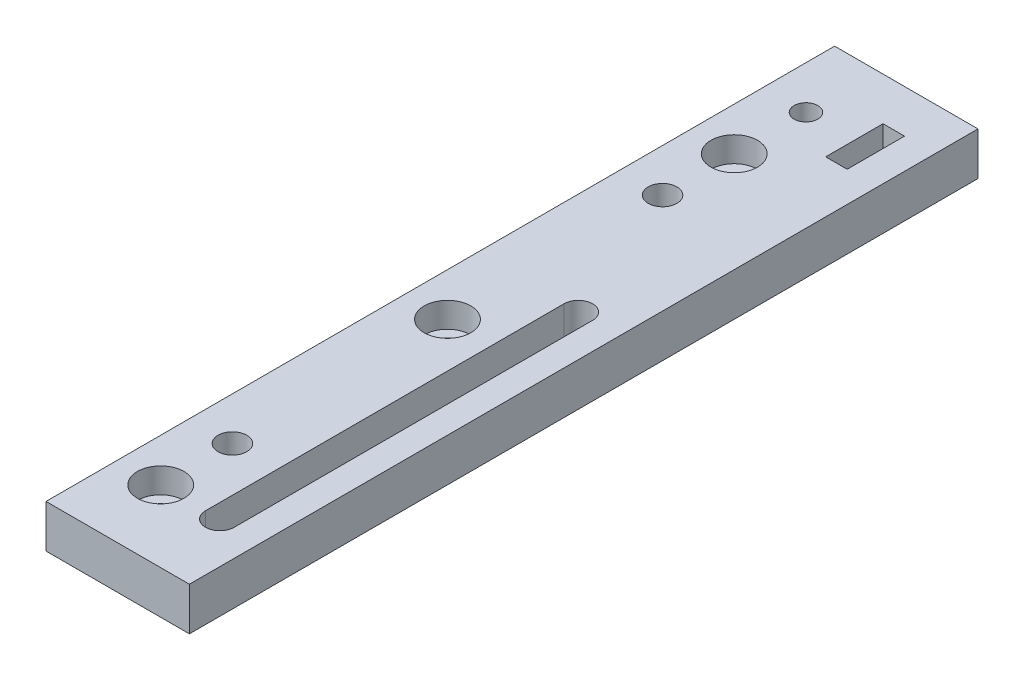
ISO-10303-21;
HEADER;
FILE_DESCRIPTION(('STEP AP214'),'2;1');
FILE_NAME('part.step','',(''),(''),'','','');
FILE_SCHEMA(('AUTOMOTIVE_DESIGN { 1 0 10303 214 1 1 1 1 }'));
ENDSEC;
DATA;
#1=APPLICATION_CONTEXT('core data for automotive mechanical design processes');
#2=APPLICATION_PROTOCOL_DEFINITION('international standard','automotive_design',2000,#1);
#3=PRODUCT_CONTEXT('',#1,'mechanical');
#4=PRODUCT('Part','Part','',(#3));
#5=PRODUCT_RELATED_PRODUCT_CATEGORY('part','',(#4));
#6=PRODUCT_DEFINITION_FORMATION('','',#4);
#7=PRODUCT_DEFINITION_CONTEXT('part definition',#1,'design');
#8=PRODUCT_DEFINITION('design','',#6,#7);
#9=PRODUCT_DEFINITION_SHAPE('','',#8);
#10=(LENGTH_UNIT() NAMED_UNIT(*) SI_UNIT(.MILLI.,.METRE.));
#11=(NAMED_UNIT(*) PLANE_ANGLE_UNIT() SI_UNIT($,.RADIAN.));
#12=(NAMED_UNIT(*) SI_UNIT($,.STERADIAN.) SOLID_ANGLE_UNIT());
#13=UNCERTAINTY_MEASURE_WITH_UNIT(LENGTH_MEASURE(1.E-05),#10,'distance_accuracy_value','');
#14=(GEOMETRIC_REPRESENTATION_CONTEXT(3) GLOBAL_UNCERTAINTY_ASSIGNED_CONTEXT((#13)) GLOBAL_UNIT_ASSIGNED_CONTEXT((#10,
#11,#12)) REPRESENTATION_CONTEXT('',''));
#15=CARTESIAN_POINT('',(0.,0.,0.));
#16=DIRECTION('',(0.,0.,1.));
#17=DIRECTION('',(1.,0.,0.));
#18=AXIS2_PLACEMENT_3D('',#15,#16,#17);
#19=CARTESIAN_POINT('',(6.,-104.,100.));
#20=DIRECTION('',(0.,1.,0.));
#21=DIRECTION('',(0.,0.,1.));
#22=AXIS2_PLACEMENT_3D('',#19,#20,#21);
#23=CYLINDRICAL_SURFACE('',#22,1.75);
#24=CARTESIAN_POINT('',(6.,0.,100.));
#25=DIRECTION('',(0.,1.,0.));
#26=DIRECTION('',(0.,0.,1.));
#27=AXIS2_PLACEMENT_3D('',#24,#25,#26);
#28=CIRCLE('',#27,1.75);
#29=CARTESIAN_POINT('',(6.,0.,101.75));
#30=VERTEX_POINT('',#29);
#31=EDGE_CURVE('E208',#30,#30,#28,.T.);
#32=ORIENTED_EDGE('',*,*,#31,.F.);
#33=EDGE_LOOP('',(#32));
#34=FACE_BOUND('',#33,.T.);
#35=CARTESIAN_POINT('',(6.,2.5,100.));
#36=DIRECTION('',(0.,1.,0.));
#37=DIRECTION('',(0.,0.,1.));
#38=AXIS2_PLACEMENT_3D('',#35,#36,#37);
#39=CIRCLE('',#38,1.75);
#40=CARTESIAN_POINT('',(6.,2.5,101.75));
#41=VERTEX_POINT('',#40);
#42=EDGE_CURVE('E40',#41,#41,#39,.F.);
#43=ORIENTED_EDGE('',*,*,#42,.F.);
#44=EDGE_LOOP('',(#43));
#45=FACE_BOUND('',#44,.T.);
#46=ADVANCED_FACE('F36',(#34,#45),#23,.F.);
#47=CARTESIAN_POINT('',(6.,-104.,60.));
#48=DIRECTION('',(0.,1.,0.));
#49=DIRECTION('',(0.,0.,1.));
#50=AXIS2_PLACEMENT_3D('',#47,#48,#49);
#51=CYLINDRICAL_SURFACE('',#50,1.75);
#52=CARTESIAN_POINT('',(6.,0.,60.));
#53=DIRECTION('',(0.,1.,0.));
#54=DIRECTION('',(0.,0.,1.));
#55=AXIS2_PLACEMENT_3D('',#52,#53,#54);
#56=CIRCLE('',#55,1.75);
#57=CARTESIAN_POINT('',(6.,0.,61.75));
#58=VERTEX_POINT('',#57);
#59=EDGE_CURVE('E211',#58,#58,#56,.T.);
#60=ORIENTED_EDGE('',*,*,#59,.F.);
#61=EDGE_LOOP('',(#60));
#62=FACE_BOUND('',#61,.T.);
#63=CARTESIAN_POINT('',(6.,2.5,60.));
#64=DIRECTION('',(0.,1.,0.));
#65=DIRECTION('',(0.,0.,1.));
#66=AXIS2_PLACEMENT_3D('',#63,#64,#65);
#67=CIRCLE('',#66,1.75);
#68=CARTESIAN_POINT('',(6.,2.5,61.75));
#69=VERTEX_POINT('',#68);
#70=EDGE_CURVE('E247',#69,#69,#67,.F.);
#71=ORIENTED_EDGE('',*,*,#70,.F.);
#72=EDGE_LOOP('',(#71));
#73=FACE_BOUND('',#72,.T.);
#74=ADVANCED_FACE('F292',(#62,#73),#51,.F.);
#75=CARTESIAN_POINT('',(6.,-104.,20.));
#76=DIRECTION('',(0.,1.,0.));
#77=DIRECTION('',(0.,0.,1.));
#78=AXIS2_PLACEMENT_3D('',#75,#76,#77);
#79=CYLINDRICAL_SURFACE('',#78,1.75);
#80=CARTESIAN_POINT('',(6.,0.,20.));
#81=DIRECTION('',(0.,1.,0.));
#82=DIRECTION('',(0.,0.,1.));
#83=AXIS2_PLACEMENT_3D('',#80,#81,#82);
#84=CIRCLE('',#83,1.75);
#85=CARTESIAN_POINT('',(6.,0.,21.75));
#86=VERTEX_POINT('',#85);
#87=EDGE_CURVE('E214',#86,#86,#84,.T.);
#88=ORIENTED_EDGE('',*,*,#87,.F.);
#89=EDGE_LOOP('',(#88));
#90=FACE_BOUND('',#89,.T.);
#91=CARTESIAN_POINT('',(6.,2.5,20.));
#92=DIRECTION('',(0.,1.,0.));
#93=DIRECTION('',(0.,0.,1.));
#94=AXIS2_PLACEMENT_3D('',#91,#92,#93);
#95=CIRCLE('',#94,1.75);
#96=CARTESIAN_POINT('',(6.,2.5,21.75));
#97=VERTEX_POINT('',#96);
#98=EDGE_CURVE('E243',#97,#97,#95,.F.);
#99=ORIENTED_EDGE('',*,*,#98,.F.);
#100=EDGE_LOOP('',(#99));
#101=FACE_BOUND('',#100,.T.);
#102=ADVANCED_FACE('F298',(#90,#101),#79,.F.);
#103=CARTESIAN_POINT('',(0.,0.,110.));
#104=DIRECTION('',(0.,1.,0.));
#105=DIRECTION('',(0.,0.,1.));
#106=AXIS2_PLACEMENT_3D('',#103,#104,#105);
#107=PLANE('',#106);
#108=CARTESIAN_POINT('',(6.,0.,10.));
#109=DIRECTION('',(0.,1.,0.));
#110=DIRECTION('',(0.,0.,1.));
#111=AXIS2_PLACEMENT_3D('',#108,#109,#110);
#112=CIRCLE('',#111,1.65);
#113=CARTESIAN_POINT('',(6.,0.,11.65));
#114=VERTEX_POINT('',#113);
#115=EDGE_CURVE('E270',#114,#114,#112,.T.);
#116=ORIENTED_EDGE('',*,*,#115,.T.);
#117=EDGE_LOOP('',(#116));
#118=FACE_BOUND('',#117,.T.);
#119=DIRECTION('',(0.,0.,1.));
#120=VECTOR('',#119,1.);
#121=CARTESIAN_POINT('',(12.7500000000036,0.,110.));
#122=LINE('',#121,#120);
#123=CARTESIAN_POINT('',(12.7500000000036,0.,6.));
#124=VERTEX_POINT('',#123);
#125=CARTESIAN_POINT('',(12.7500000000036,0.,14.));
#126=VERTEX_POINT('',#125);
#127=EDGE_CURVE('E158',#124,#126,#122,.T.);
#128=ORIENTED_EDGE('',*,*,#127,.T.);
#129=DIRECTION('',(1.,0.,0.));
#130=VECTOR('',#129,1.);
#131=CARTESIAN_POINT('',(0.,0.,14.));
#132=LINE('',#131,#130);
#133=CARTESIAN_POINT('',(15.7500000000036,0.,14.));
#134=VERTEX_POINT('',#133);
#135=EDGE_CURVE('E161',#126,#134,#132,.T.);
#136=ORIENTED_EDGE('',*,*,#135,.T.);
#137=DIRECTION('',(0.,0.,-1.));
#138=VECTOR('',#137,1.);
#139=CARTESIAN_POINT('',(15.7500000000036,0.,110.));
#140=LINE('',#139,#138);
#141=CARTESIAN_POINT('',(15.7500000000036,0.,6.00000000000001));
#142=VERTEX_POINT('',#141);
#143=EDGE_CURVE('E153',#134,#142,#140,.T.);
#144=ORIENTED_EDGE('',*,*,#143,.T.);
#145=DIRECTION('',(-1.,0.,0.));
#146=VECTOR('',#145,1.);
#147=CARTESIAN_POINT('',(0.,0.,6.00000000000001));
#148=LINE('',#147,#146);
#149=EDGE_CURVE('E133',#142,#124,#148,.T.);
#150=ORIENTED_EDGE('',*,*,#149,.T.);
#151=EDGE_LOOP('',(#128,#136,#144,#150));
#152=FACE_BOUND('',#151,.T.);
#153=DIRECTION('',(0.,0.,-1.));
#154=VECTOR('',#153,1.);
#155=CARTESIAN_POINT('',(16.2500000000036,0.,110.));
#156=LINE('',#155,#154);
#157=CARTESIAN_POINT('',(16.2500000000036,0.,100.));
#158=VERTEX_POINT('',#157);
#159=CARTESIAN_POINT('',(16.2500000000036,0.,50.));
#160=VERTEX_POINT('',#159);
#161=EDGE_CURVE('E190',#158,#160,#156,.T.);
#162=ORIENTED_EDGE('',*,*,#161,.T.);
#163=CARTESIAN_POINT('',(14.2500000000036,0.,50.));
#164=DIRECTION('',(0.,1.,0.));
#165=DIRECTION('',(0.,0.,1.));
#166=AXIS2_PLACEMENT_3D('',#163,#164,#165);
#167=CIRCLE('',#166,2.);
#168=CARTESIAN_POINT('',(12.2500000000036,0.,50.));
#169=VERTEX_POINT('',#168);
#170=EDGE_CURVE('E193',#160,#169,#167,.T.);
#171=ORIENTED_EDGE('',*,*,#170,.T.);
#172=DIRECTION('',(0.,0.,1.));
#173=VECTOR('',#172,1.);
#174=CARTESIAN_POINT('',(12.2500000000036,0.,110.));
#175=LINE('',#174,#173);
#176=CARTESIAN_POINT('',(12.2500000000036,0.,100.));
#177=VERTEX_POINT('',#176);
#178=EDGE_CURVE('E178',#169,#177,#175,.T.);
#179=ORIENTED_EDGE('',*,*,#178,.T.);
#180=CARTESIAN_POINT('',(14.2500000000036,0.,100.));
#181=DIRECTION('',(0.,1.,0.));
#182=DIRECTION('',(0.,0.,1.));
#183=AXIS2_PLACEMENT_3D('',#180,#181,#182);
#184=CIRCLE('',#183,2.);
#185=EDGE_CURVE('E187',#177,#158,#184,.T.);
#186=ORIENTED_EDGE('',*,*,#185,.T.);
#187=EDGE_LOOP('',(#162,#171,#179,#186));
#188=FACE_BOUND('',#187,.T.);
#189=CARTESIAN_POINT('',(6.,0.,90.));
#190=DIRECTION('',(0.,1.,0.));
#191=DIRECTION('',(0.,0.,1.));
#192=AXIS2_PLACEMENT_3D('',#189,#190,#191);
#193=CIRCLE('',#192,2.00000000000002);
#194=CARTESIAN_POINT('',(6.,0.,92.));
#195=VERTEX_POINT('',#194);
#196=EDGE_CURVE('E199',#195,#195,#193,.T.);
#197=ORIENTED_EDGE('',*,*,#196,.T.);
#198=EDGE_LOOP('',(#197));
#199=FACE_BOUND('',#198,.T.);
#200=CARTESIAN_POINT('',(6.,0.,30.));
#201=DIRECTION('',(0.,1.,0.));
#202=DIRECTION('',(0.,0.,1.));
#203=AXIS2_PLACEMENT_3D('',#200,#201,#202);
#204=CIRCLE('',#203,2.00000000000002);
#205=CARTESIAN_POINT('',(6.,0.,32.));
#206=VERTEX_POINT('',#205);
#207=EDGE_CURVE('E205',#206,#206,#204,.T.);
#208=ORIENTED_EDGE('',*,*,#207,.T.);
#209=EDGE_LOOP('',(#208));
#210=FACE_BOUND('',#209,.T.);
#211=ORIENTED_EDGE('',*,*,#31,.T.);
#212=EDGE_LOOP('',(#211));
#213=FACE_BOUND('',#212,.T.);
#214=ORIENTED_EDGE('',*,*,#59,.T.);
#215=EDGE_LOOP('',(#214));
#216=FACE_BOUND('',#215,.T.);
#217=ORIENTED_EDGE('',*,*,#87,.T.);
#218=EDGE_LOOP('',(#217));
#219=FACE_BOUND('',#218,.T.);
#220=DIRECTION('',(1.,0.,0.));
#221=VECTOR('',#220,1.);
#222=CARTESIAN_POINT('',(0.,0.,0.));
#223=LINE('',#222,#221);
#224=CARTESIAN_POINT('',(0.,0.,0.));
#225=VERTEX_POINT('',#224);
#226=CARTESIAN_POINT('',(20.,0.,0.));
#227=VERTEX_POINT('',#226);
#228=EDGE_CURVE('E217',#225,#227,#223,.T.);
#229=ORIENTED_EDGE('',*,*,#228,.T.);
#230=DIRECTION('',(0.,0.,-1.));
#231=VECTOR('',#230,1.);
#232=CARTESIAN_POINT('',(20.,0.,110.));
#233=LINE('',#232,#231);
#234=CARTESIAN_POINT('',(20.,0.,110.));
#235=VERTEX_POINT('',#234);
#236=EDGE_CURVE('E12',#235,#227,#233,.T.);
#237=ORIENTED_EDGE('',*,*,#236,.F.);
#238=DIRECTION('',(1.,0.,0.));
#239=VECTOR('',#238,1.);
#240=CARTESIAN_POINT('',(0.,0.,110.));
#241=LINE('',#240,#239);
#242=CARTESIAN_POINT('',(0.,0.,110.));
#243=VERTEX_POINT('',#242);
#244=EDGE_CURVE('E218',#243,#235,#241,.T.);
#245=ORIENTED_EDGE('',*,*,#244,.F.);
#246=DIRECTION('',(0.,0.,-1.));
#247=VECTOR('',#246,1.);
#248=CARTESIAN_POINT('',(0.,0.,110.));
#249=LINE('',#248,#247);
#250=EDGE_CURVE('E228',#243,#225,#249,.T.);
#251=ORIENTED_EDGE('',*,*,#250,.T.);
#252=EDGE_LOOP('',(#229,#237,#245,#251));
#253=FACE_BOUND('',#252,.T.);
#254=ADVANCED_FACE('F38',(#118,#152,#188,#199,#210,#213,#216,#219,#253),#107,.F.);
#255=CARTESIAN_POINT('',(20.,0.,110.));
#256=DIRECTION('',(-1.,0.,0.));
#257=DIRECTION('',(0.,0.,1.));
#258=AXIS2_PLACEMENT_3D('',#255,#256,#257);
#259=PLANE('',#258);
#260=DIRECTION('',(0.,1.,0.));
#261=VECTOR('',#260,1.);
#262=CARTESIAN_POINT('',(20.,0.,0.));
#263=LINE('',#262,#261);
#264=CARTESIAN_POINT('',(20.,6.,0.));
#265=VERTEX_POINT('',#264);
#266=EDGE_CURVE('E231',#227,#265,#263,.T.);
#267=ORIENTED_EDGE('',*,*,#266,.T.);
#268=DIRECTION('',(0.,0.,-1.));
#269=VECTOR('',#268,1.);
#270=CARTESIAN_POINT('',(20.,6.,110.));
#271=LINE('',#270,#269);
#272=CARTESIAN_POINT('',(20.,6.,110.));
#273=VERTEX_POINT('',#272);
#274=EDGE_CURVE('E45',#273,#265,#271,.T.);
#275=ORIENTED_EDGE('',*,*,#274,.F.);
#276=DIRECTION('',(0.,1.,0.));
#277=VECTOR('',#276,1.);
#278=CARTESIAN_POINT('',(20.,0.,110.));
#279=LINE('',#278,#277);
#280=EDGE_CURVE('E221',#235,#273,#279,.T.);
#281=ORIENTED_EDGE('',*,*,#280,.F.);
#282=ORIENTED_EDGE('',*,*,#236,.T.);
#283=EDGE_LOOP('',(#267,#275,#281,#282));
#284=FACE_BOUND('',#283,.T.);
#285=ADVANCED_FACE('F323',(#284),#259,.F.);
#286=CARTESIAN_POINT('',(0.,6.,110.));
#287=DIRECTION('',(0.,-1.,0.));
#288=DIRECTION('',(0.,0.,-1.));
#289=AXIS2_PLACEMENT_3D('',#286,#287,#288);
#290=PLANE('',#289);
#291=CARTESIAN_POINT('',(6.,6.,100.));
#292=DIRECTION('',(0.,1.,0.));
#293=DIRECTION('',(0.,0.,1.));
#294=AXIS2_PLACEMENT_3D('',#291,#292,#293);
#295=CIRCLE('',#294,3.25);
#296=CARTESIAN_POINT('',(6.,6.,103.25));
#297=VERTEX_POINT('',#296);
#298=EDGE_CURVE('E263',#297,#297,#295,.T.);
#299=ORIENTED_EDGE('',*,*,#298,.F.);
#300=EDGE_LOOP('',(#299));
#301=FACE_BOUND('',#300,.T.);
#302=CARTESIAN_POINT('',(6.,6.,60.));
#303=DIRECTION('',(0.,1.,0.));
#304=DIRECTION('',(0.,0.,1.));
#305=AXIS2_PLACEMENT_3D('',#302,#303,#304);
#306=CIRCLE('',#305,3.25);
#307=CARTESIAN_POINT('',(6.,6.,63.25));
#308=VERTEX_POINT('',#307);
#309=EDGE_CURVE('E256',#308,#308,#306,.T.);
#310=ORIENTED_EDGE('',*,*,#309,.F.);
#311=EDGE_LOOP('',(#310));
#312=FACE_BOUND('',#311,.T.);
#313=CARTESIAN_POINT('',(6.,6.,20.));
#314=DIRECTION('',(0.,1.,0.));
#315=DIRECTION('',(0.,0.,1.));
#316=AXIS2_PLACEMENT_3D('',#313,#314,#315);
#317=CIRCLE('',#316,3.25);
#318=CARTESIAN_POINT('',(6.,6.,23.25));
#319=VERTEX_POINT('',#318);
#320=EDGE_CURVE('E249',#319,#319,#317,.T.);
#321=ORIENTED_EDGE('',*,*,#320,.F.);
#322=EDGE_LOOP('',(#321));
#323=FACE_BOUND('',#322,.T.);
#324=CARTESIAN_POINT('',(6.,6.,10.));
#325=DIRECTION('',(0.,1.,0.));
#326=DIRECTION('',(0.,0.,1.));
#327=AXIS2_PLACEMENT_3D('',#324,#325,#326);
#328=CIRCLE('',#327,1.65);
#329=CARTESIAN_POINT('',(6.,6.,11.65));
#330=VERTEX_POINT('',#329);
#331=EDGE_CURVE('E245',#330,#330,#328,.T.);
#332=ORIENTED_EDGE('',*,*,#331,.F.);
#333=EDGE_LOOP('',(#332));
#334=FACE_BOUND('',#333,.T.);
#335=DIRECTION('',(0.,0.,-1.));
#336=VECTOR('',#335,1.);
#337=CARTESIAN_POINT('',(15.7500000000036,6.,14.));
#338=LINE('',#337,#336);
#339=CARTESIAN_POINT('',(15.7500000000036,6.,14.));
#340=VERTEX_POINT('',#339);
#341=CARTESIAN_POINT('',(15.7500000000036,6.,6.));
#342=VERTEX_POINT('',#341);
#343=EDGE_CURVE('E139',#340,#342,#338,.T.);
#344=ORIENTED_EDGE('',*,*,#343,.F.);
#345=DIRECTION('',(1.,0.,0.));
#346=VECTOR('',#345,1.);
#347=CARTESIAN_POINT('',(12.7500000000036,6.,14.));
#348=LINE('',#347,#346);
#349=CARTESIAN_POINT('',(12.7500000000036,6.,14.));
#350=VERTEX_POINT('',#349);
#351=EDGE_CURVE('E61',#350,#340,#348,.T.);
#352=ORIENTED_EDGE('',*,*,#351,.F.);
#353=DIRECTION('',(0.,0.,1.));
#354=VECTOR('',#353,1.);
#355=CARTESIAN_POINT('',(12.7500000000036,6.,14.));
#356=LINE('',#355,#354);
#357=CARTESIAN_POINT('',(12.7500000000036,6.,6.));
#358=VERTEX_POINT('',#357);
#359=EDGE_CURVE('E146',#358,#350,#356,.T.);
#360=ORIENTED_EDGE('',*,*,#359,.F.);
#361=DIRECTION('',(-1.,0.,0.));
#362=VECTOR('',#361,1.);
#363=CARTESIAN_POINT('',(12.7500000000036,6.,6.));
#364=LINE('',#363,#362);
#365=EDGE_CURVE('E130',#342,#358,#364,.T.);
#366=ORIENTED_EDGE('',*,*,#365,.F.);
#367=EDGE_LOOP('',(#344,#352,#360,#366));
#368=FACE_BOUND('',#367,.T.);
#369=DIRECTION('',(0.,0.,1.));
#370=VECTOR('',#369,1.);
#371=CARTESIAN_POINT('',(12.2500000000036,6.,50.));
#372=LINE('',#371,#370);
#373=CARTESIAN_POINT('',(12.2500000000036,6.,50.));
#374=VERTEX_POINT('',#373);
#375=CARTESIAN_POINT('',(12.2500000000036,6.,100.));
#376=VERTEX_POINT('',#375);
#377=EDGE_CURVE('E166',#374,#376,#372,.T.);
#378=ORIENTED_EDGE('',*,*,#377,.F.);
#379=CARTESIAN_POINT('',(14.2500000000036,6.,50.));
#380=DIRECTION('',(0.,1.,0.));
#381=DIRECTION('',(0.,0.,1.));
#382=AXIS2_PLACEMENT_3D('',#379,#380,#381);
#383=CIRCLE('',#382,2.);
#384=CARTESIAN_POINT('',(16.2500000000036,6.,50.));
#385=VERTEX_POINT('',#384);
#386=EDGE_CURVE('E164',#385,#374,#383,.T.);
#387=ORIENTED_EDGE('',*,*,#386,.F.);
#388=DIRECTION('',(0.,0.,-1.));
#389=VECTOR('',#388,1.);
#390=CARTESIAN_POINT('',(16.2500000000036,6.,100.));
#391=LINE('',#390,#389);
#392=CARTESIAN_POINT('',(16.2500000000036,6.,100.));
#393=VERTEX_POINT('',#392);
#394=EDGE_CURVE('E172',#393,#385,#391,.T.);
#395=ORIENTED_EDGE('',*,*,#394,.F.);
#396=CARTESIAN_POINT('',(14.2500000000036,6.,100.));
#397=DIRECTION('',(0.,1.,0.));
#398=DIRECTION('',(0.,0.,1.));
#399=AXIS2_PLACEMENT_3D('',#396,#397,#398);
#400=CIRCLE('',#399,2.);
#401=EDGE_CURVE('E169',#376,#393,#400,.T.);
#402=ORIENTED_EDGE('',*,*,#401,.F.);
#403=EDGE_LOOP('',(#378,#387,#395,#402));
#404=FACE_BOUND('',#403,.T.);
#405=CARTESIAN_POINT('',(6.,6.,90.));
#406=DIRECTION('',(0.,1.,0.));
#407=DIRECTION('',(0.,0.,1.));
#408=AXIS2_PLACEMENT_3D('',#405,#406,#407);
#409=CIRCLE('',#408,2.00000000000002);
#410=CARTESIAN_POINT('',(6.,6.,92.));
#411=VERTEX_POINT('',#410);
#412=EDGE_CURVE('E196',#411,#411,#409,.T.);
#413=ORIENTED_EDGE('',*,*,#412,.F.);
#414=EDGE_LOOP('',(#413));
#415=FACE_BOUND('',#414,.T.);
#416=CARTESIAN_POINT('',(6.,6.,30.));
#417=DIRECTION('',(0.,1.,0.));
#418=DIRECTION('',(0.,0.,1.));
#419=AXIS2_PLACEMENT_3D('',#416,#417,#418);
#420=CIRCLE('',#419,2.00000000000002);
#421=CARTESIAN_POINT('',(6.,6.,32.));
#422=VERTEX_POINT('',#421);
#423=EDGE_CURVE('E202',#422,#422,#420,.T.);
#424=ORIENTED_EDGE('',*,*,#423,.F.);
#425=EDGE_LOOP('',(#424));
#426=FACE_BOUND('',#425,.T.);
#427=DIRECTION('',(-1.,0.,0.));
#428=VECTOR('',#427,1.);
#429=CARTESIAN_POINT('',(0.,6.,0.));
#430=LINE('',#429,#428);
#431=CARTESIAN_POINT('',(0.,6.,0.));
#432=VERTEX_POINT('',#431);
#433=EDGE_CURVE('E233',#265,#432,#430,.T.);
#434=ORIENTED_EDGE('',*,*,#433,.T.);
#435=DIRECTION('',(0.,0.,-1.));
#436=VECTOR('',#435,1.);
#437=CARTESIAN_POINT('',(0.,6.,110.));
#438=LINE('',#437,#436);
#439=CARTESIAN_POINT('',(0.,6.,110.));
#440=VERTEX_POINT('',#439);
#441=EDGE_CURVE('E238',#440,#432,#438,.T.);
#442=ORIENTED_EDGE('',*,*,#441,.F.);
#443=DIRECTION('',(-1.,0.,0.));
#444=VECTOR('',#443,1.);
#445=CARTESIAN_POINT('',(0.,6.,110.));
#446=LINE('',#445,#444);
#447=EDGE_CURVE('E224',#273,#440,#446,.T.);
#448=ORIENTED_EDGE('',*,*,#447,.F.);
#449=ORIENTED_EDGE('',*,*,#274,.T.);
#450=EDGE_LOOP('',(#434,#442,#448,#449));
#451=FACE_BOUND('',#450,.T.);
#452=ADVANCED_FACE('F143',(#301,#312,#323,#334,#368,#404,#415,#426,#451),#290,.F.);
#453=CARTESIAN_POINT('',(0.,0.,110.));
#454=DIRECTION('',(1.,0.,0.));
#455=DIRECTION('',(0.,0.,-1.));
#456=AXIS2_PLACEMENT_3D('',#453,#454,#455);
#457=PLANE('',#456);
#458=DIRECTION('',(0.,-1.,0.));
#459=VECTOR('',#458,1.);
#460=CARTESIAN_POINT('',(0.,0.,0.));
#461=LINE('',#460,#459);
#462=EDGE_CURVE('E222',#432,#225,#461,.T.);
#463=ORIENTED_EDGE('',*,*,#462,.T.);
#464=ORIENTED_EDGE('',*,*,#250,.F.);
#465=DIRECTION('',(0.,-1.,0.));
#466=VECTOR('',#465,1.);
#467=CARTESIAN_POINT('',(0.,0.,110.));
#468=LINE('',#467,#466);
#469=EDGE_CURVE('E226',#440,#243,#468,.T.);
#470=ORIENTED_EDGE('',*,*,#469,.F.);
#471=ORIENTED_EDGE('',*,*,#441,.T.);
#472=EDGE_LOOP('',(#463,#464,#470,#471));
#473=FACE_BOUND('',#472,.T.);
#474=ADVANCED_FACE('F314',(#473),#457,.F.);
#475=CARTESIAN_POINT('',(20.,0.,110.));
#476=DIRECTION('',(0.,0.,1.));
#477=DIRECTION('',(1.,0.,0.));
#478=AXIS2_PLACEMENT_3D('',#475,#476,#477);
#479=PLANE('',#478);
#480=ORIENTED_EDGE('',*,*,#244,.T.);
#481=ORIENTED_EDGE('',*,*,#280,.T.);
#482=ORIENTED_EDGE('',*,*,#447,.T.);
#483=ORIENTED_EDGE('',*,*,#469,.T.);
#484=EDGE_LOOP('',(#480,#481,#482,#483));
#485=FACE_BOUND('',#484,.T.);
#486=ADVANCED_FACE('F310',(#485),#479,.T.);
#487=CARTESIAN_POINT('',(20.,0.,0.));
#488=DIRECTION('',(0.,0.,1.));
#489=DIRECTION('',(1.,0.,0.));
#490=AXIS2_PLACEMENT_3D('',#487,#488,#489);
#491=PLANE('',#490);
#492=ORIENTED_EDGE('',*,*,#228,.F.);
#493=ORIENTED_EDGE('',*,*,#462,.F.);
#494=ORIENTED_EDGE('',*,*,#433,.F.);
#495=ORIENTED_EDGE('',*,*,#266,.F.);
#496=EDGE_LOOP('',(#492,#493,#494,#495));
#497=FACE_BOUND('',#496,.T.);
#498=ADVANCED_FACE('F313',(#497),#491,.F.);
#499=CARTESIAN_POINT('',(6.,-104.,30.));
#500=DIRECTION('',(0.,1.,0.));
#501=DIRECTION('',(0.,0.,1.));
#502=AXIS2_PLACEMENT_3D('',#499,#500,#501);
#503=CYLINDRICAL_SURFACE('',#502,2.00000000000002);
#504=ORIENTED_EDGE('',*,*,#423,.T.);
#505=EDGE_LOOP('',(#504));
#506=FACE_BOUND('',#505,.T.);
#507=ORIENTED_EDGE('',*,*,#207,.F.);
#508=EDGE_LOOP('',(#507));
#509=FACE_BOUND('',#508,.T.);
#510=ADVANCED_FACE('F304',(#506,#509),#503,.F.);
#511=CARTESIAN_POINT('',(6.,-104.,90.));
#512=DIRECTION('',(0.,1.,0.));
#513=DIRECTION('',(0.,0.,1.));
#514=AXIS2_PLACEMENT_3D('',#511,#512,#513);
#515=CYLINDRICAL_SURFACE('',#514,2.00000000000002);
#516=ORIENTED_EDGE('',*,*,#412,.T.);
#517=EDGE_LOOP('',(#516));
#518=FACE_BOUND('',#517,.T.);
#519=ORIENTED_EDGE('',*,*,#196,.F.);
#520=EDGE_LOOP('',(#519));
#521=FACE_BOUND('',#520,.T.);
#522=ADVANCED_FACE('F436',(#518,#521),#515,.F.);
#523=CARTESIAN_POINT('',(14.2500000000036,-104.,50.));
#524=DIRECTION('',(0.,1.,0.));
#525=DIRECTION('',(0.,0.,1.));
#526=AXIS2_PLACEMENT_3D('',#523,#524,#525);
#527=CYLINDRICAL_SURFACE('',#526,2.);
#528=DIRECTION('',(0.,1.,0.));
#529=VECTOR('',#528,1.);
#530=CARTESIAN_POINT('',(16.2500000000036,-104.,50.));
#531=LINE('',#530,#529);
#532=EDGE_CURVE('E176',#160,#385,#531,.T.);
#533=ORIENTED_EDGE('',*,*,#532,.T.);
#534=ORIENTED_EDGE('',*,*,#386,.T.);
#535=DIRECTION('',(0.,1.,0.));
#536=VECTOR('',#535,1.);
#537=CARTESIAN_POINT('',(12.2500000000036,-104.,50.));
#538=LINE('',#537,#536);
#539=EDGE_CURVE('E175',#169,#374,#538,.T.);
#540=ORIENTED_EDGE('',*,*,#539,.F.);
#541=ORIENTED_EDGE('',*,*,#170,.F.);
#542=EDGE_LOOP('',(#533,#534,#540,#541));
#543=FACE_BOUND('',#542,.T.);
#544=ADVANCED_FACE('F426',(#543),#527,.F.);
#545=CARTESIAN_POINT('',(16.2500000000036,-104.,100.));
#546=DIRECTION('',(1.,0.,0.));
#547=DIRECTION('',(0.,0.,-1.));
#548=AXIS2_PLACEMENT_3D('',#545,#546,#547);
#549=PLANE('',#548);
#550=DIRECTION('',(0.,1.,0.));
#551=VECTOR('',#550,1.);
#552=CARTESIAN_POINT('',(16.2500000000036,-104.,100.));
#553=LINE('',#552,#551);
#554=EDGE_CURVE('E179',#158,#393,#553,.T.);
#555=ORIENTED_EDGE('',*,*,#554,.T.);
#556=ORIENTED_EDGE('',*,*,#394,.T.);
#557=ORIENTED_EDGE('',*,*,#532,.F.);
#558=ORIENTED_EDGE('',*,*,#161,.F.);
#559=EDGE_LOOP('',(#555,#556,#557,#558));
#560=FACE_BOUND('',#559,.T.);
#561=ADVANCED_FACE('F416',(#560),#549,.F.);
#562=CARTESIAN_POINT('',(14.2500000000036,-104.,100.));
#563=DIRECTION('',(0.,1.,0.));
#564=DIRECTION('',(0.,0.,1.));
#565=AXIS2_PLACEMENT_3D('',#562,#563,#564);
#566=CYLINDRICAL_SURFACE('',#565,2.);
#567=DIRECTION('',(0.,1.,0.));
#568=VECTOR('',#567,1.);
#569=CARTESIAN_POINT('',(12.2500000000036,-104.,100.));
#570=LINE('',#569,#568);
#571=EDGE_CURVE('E181',#177,#376,#570,.T.);
#572=ORIENTED_EDGE('',*,*,#571,.T.);
#573=ORIENTED_EDGE('',*,*,#401,.T.);
#574=ORIENTED_EDGE('',*,*,#554,.F.);
#575=ORIENTED_EDGE('',*,*,#185,.F.);
#576=EDGE_LOOP('',(#572,#573,#574,#575));
#577=FACE_BOUND('',#576,.T.);
#578=ADVANCED_FACE('F406',(#577),#566,.F.);
#579=CARTESIAN_POINT('',(12.2500000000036,-104.,50.));
#580=DIRECTION('',(-1.,0.,0.));
#581=DIRECTION('',(0.,0.,1.));
#582=AXIS2_PLACEMENT_3D('',#579,#580,#581);
#583=PLANE('',#582);
#584=ORIENTED_EDGE('',*,*,#539,.T.);
#585=ORIENTED_EDGE('',*,*,#377,.T.);
#586=ORIENTED_EDGE('',*,*,#571,.F.);
#587=ORIENTED_EDGE('',*,*,#178,.F.);
#588=EDGE_LOOP('',(#584,#585,#586,#587));
#589=FACE_BOUND('',#588,.T.);
#590=ADVANCED_FACE('F397',(#589),#583,.F.);
#591=CARTESIAN_POINT('',(12.7500000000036,-104.,14.));
#592=DIRECTION('',(0.,0.,1.));
#593=DIRECTION('',(1.,0.,0.));
#594=AXIS2_PLACEMENT_3D('',#591,#592,#593);
#595=PLANE('',#594);
#596=DIRECTION('',(0.,1.,0.));
#597=VECTOR('',#596,1.);
#598=CARTESIAN_POINT('',(12.7500000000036,-104.,14.));
#599=LINE('',#598,#597);
#600=EDGE_CURVE('E151',#126,#350,#599,.T.);
#601=ORIENTED_EDGE('',*,*,#600,.T.);
#602=ORIENTED_EDGE('',*,*,#351,.T.);
#603=DIRECTION('',(0.,1.,0.));
#604=VECTOR('',#603,1.);
#605=CARTESIAN_POINT('',(15.7500000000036,-104.,14.));
#606=LINE('',#605,#604);
#607=EDGE_CURVE('E136',#134,#340,#606,.T.);
#608=ORIENTED_EDGE('',*,*,#607,.F.);
#609=ORIENTED_EDGE('',*,*,#135,.F.);
#610=EDGE_LOOP('',(#601,#602,#608,#609));
#611=FACE_BOUND('',#610,.T.);
#612=ADVANCED_FACE('F388',(#611),#595,.F.);
#613=CARTESIAN_POINT('',(12.7500000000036,-104.,14.));
#614=DIRECTION('',(-1.,0.,0.));
#615=DIRECTION('',(0.,0.,1.));
#616=AXIS2_PLACEMENT_3D('',#613,#614,#615);
#617=PLANE('',#616);
#618=DIRECTION('',(0.,1.,0.));
#619=VECTOR('',#618,1.);
#620=CARTESIAN_POINT('',(12.7500000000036,-104.,6.));
#621=LINE('',#620,#619);
#622=EDGE_CURVE('E135',#124,#358,#621,.T.);
#623=ORIENTED_EDGE('',*,*,#622,.T.);
#624=ORIENTED_EDGE('',*,*,#359,.T.);
#625=ORIENTED_EDGE('',*,*,#600,.F.);
#626=ORIENTED_EDGE('',*,*,#127,.F.);
#627=EDGE_LOOP('',(#623,#624,#625,#626));
#628=FACE_BOUND('',#627,.T.);
#629=ADVANCED_FACE('F379',(#628),#617,.F.);
#630=CARTESIAN_POINT('',(12.7500000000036,-104.,6.));
#631=DIRECTION('',(0.,0.,-1.));
#632=DIRECTION('',(-1.,0.,0.));
#633=AXIS2_PLACEMENT_3D('',#630,#631,#632);
#634=PLANE('',#633);
#635=DIRECTION('',(0.,1.,0.));
#636=VECTOR('',#635,1.);
#637=CARTESIAN_POINT('',(15.7500000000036,-104.,6.));
#638=LINE('',#637,#636);
#639=EDGE_CURVE('E53',#142,#342,#638,.T.);
#640=ORIENTED_EDGE('',*,*,#639,.T.);
#641=ORIENTED_EDGE('',*,*,#365,.T.);
#642=ORIENTED_EDGE('',*,*,#622,.F.);
#643=ORIENTED_EDGE('',*,*,#149,.F.);
#644=EDGE_LOOP('',(#640,#641,#642,#643));
#645=FACE_BOUND('',#644,.T.);
#646=ADVANCED_FACE('F127',(#645),#634,.F.);
#647=CARTESIAN_POINT('',(15.7500000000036,-104.,14.));
#648=DIRECTION('',(1.,0.,0.));
#649=DIRECTION('',(0.,0.,-1.));
#650=AXIS2_PLACEMENT_3D('',#647,#648,#649);
#651=PLANE('',#650);
#652=ORIENTED_EDGE('',*,*,#607,.T.);
#653=ORIENTED_EDGE('',*,*,#343,.T.);
#654=ORIENTED_EDGE('',*,*,#639,.F.);
#655=ORIENTED_EDGE('',*,*,#143,.F.);
#656=EDGE_LOOP('',(#652,#653,#654,#655));
#657=FACE_BOUND('',#656,.T.);
#658=ADVANCED_FACE('F140',(#657),#651,.F.);
#659=CARTESIAN_POINT('',(6.,-104.,10.));
#660=DIRECTION('',(0.,1.,0.));
#661=DIRECTION('',(0.,0.,1.));
#662=AXIS2_PLACEMENT_3D('',#659,#660,#661);
#663=CYLINDRICAL_SURFACE('',#662,1.65);
#664=ORIENTED_EDGE('',*,*,#331,.T.);
#665=EDGE_LOOP('',(#664));
#666=FACE_BOUND('',#665,.T.);
#667=ORIENTED_EDGE('',*,*,#115,.F.);
#668=EDGE_LOOP('',(#667));
#669=FACE_BOUND('',#668,.T.);
#670=ADVANCED_FACE('F276',(#666,#669),#663,.F.);
#671=CARTESIAN_POINT('',(6.,2.5,20.));
#672=DIRECTION('',(0.,1.,0.));
#673=DIRECTION('',(0.,0.,1.));
#674=AXIS2_PLACEMENT_3D('',#671,#672,#673);
#675=PLANE('',#674);
#676=CARTESIAN_POINT('',(6.,2.5,20.));
#677=DIRECTION('',(0.,1.,0.));
#678=DIRECTION('',(0.,0.,1.));
#679=AXIS2_PLACEMENT_3D('',#676,#677,#678);
#680=CIRCLE('',#679,3.25);
#681=CARTESIAN_POINT('',(6.,2.5,23.25));
#682=VERTEX_POINT('',#681);
#683=EDGE_CURVE('E246',#682,#682,#680,.T.);
#684=ORIENTED_EDGE('',*,*,#683,.T.);
#685=EDGE_LOOP('',(#684));
#686=FACE_BOUND('',#685,.T.);
#687=ORIENTED_EDGE('',*,*,#98,.T.);
#688=EDGE_LOOP('',(#687));
#689=FACE_BOUND('',#688,.T.);
#690=ADVANCED_FACE('F278',(#686,#689),#675,.T.);
#691=CARTESIAN_POINT('',(6.,2.5,20.));
#692=DIRECTION('',(0.,1.,0.));
#693=DIRECTION('',(0.,0.,1.));
#694=AXIS2_PLACEMENT_3D('',#691,#692,#693);
#695=CYLINDRICAL_SURFACE('',#694,3.25);
#696=ORIENTED_EDGE('',*,*,#683,.F.);
#697=EDGE_LOOP('',(#696));
#698=FACE_BOUND('',#697,.T.);
#699=ORIENTED_EDGE('',*,*,#320,.T.);
#700=EDGE_LOOP('',(#699));
#701=FACE_BOUND('',#700,.T.);
#702=ADVANCED_FACE('F285',(#698,#701),#695,.F.);
#703=CARTESIAN_POINT('',(6.,2.5,60.));
#704=DIRECTION('',(0.,1.,0.));
#705=DIRECTION('',(0.,0.,1.));
#706=AXIS2_PLACEMENT_3D('',#703,#704,#705);
#707=PLANE('',#706);
#708=CARTESIAN_POINT('',(6.,2.5,60.));
#709=DIRECTION('',(0.,1.,0.));
#710=DIRECTION('',(0.,0.,1.));
#711=AXIS2_PLACEMENT_3D('',#708,#709,#710);
#712=CIRCLE('',#711,3.25);
#713=CARTESIAN_POINT('',(6.,2.5,63.25));
#714=VERTEX_POINT('',#713);
#715=EDGE_CURVE('E250',#714,#714,#712,.T.);
#716=ORIENTED_EDGE('',*,*,#715,.T.);
#717=EDGE_LOOP('',(#716));
#718=FACE_BOUND('',#717,.T.);
#719=ORIENTED_EDGE('',*,*,#70,.T.);
#720=EDGE_LOOP('',(#719));
#721=FACE_BOUND('',#720,.T.);
#722=ADVANCED_FACE('F483',(#718,#721),#707,.T.);
#723=CARTESIAN_POINT('',(6.,2.5,60.));
#724=DIRECTION('',(0.,1.,0.));
#725=DIRECTION('',(0.,0.,1.));
#726=AXIS2_PLACEMENT_3D('',#723,#724,#725);
#727=CYLINDRICAL_SURFACE('',#726,3.25);
#728=ORIENTED_EDGE('',*,*,#715,.F.);
#729=EDGE_LOOP('',(#728));
#730=FACE_BOUND('',#729,.T.);
#731=ORIENTED_EDGE('',*,*,#309,.T.);
#732=EDGE_LOOP('',(#731));
#733=FACE_BOUND('',#732,.T.);
#734=ADVANCED_FACE('F492',(#730,#733),#727,.F.);
#735=CARTESIAN_POINT('',(6.,2.5,100.));
#736=DIRECTION('',(0.,1.,0.));
#737=DIRECTION('',(0.,0.,1.));
#738=AXIS2_PLACEMENT_3D('',#735,#736,#737);
#739=PLANE('',#738);
#740=CARTESIAN_POINT('',(6.,2.5,100.));
#741=DIRECTION('',(0.,1.,0.));
#742=DIRECTION('',(0.,0.,1.));
#743=AXIS2_PLACEMENT_3D('',#740,#741,#742);
#744=CIRCLE('',#743,3.25);
#745=CARTESIAN_POINT('',(6.,2.5,103.25));
#746=VERTEX_POINT('',#745);
#747=EDGE_CURVE('E528',#746,#746,#744,.T.);
#748=ORIENTED_EDGE('',*,*,#747,.T.);
#749=EDGE_LOOP('',(#748));
#750=FACE_BOUND('',#749,.T.);
#751=ORIENTED_EDGE('',*,*,#42,.T.);
#752=EDGE_LOOP('',(#751));
#753=FACE_BOUND('',#752,.T.);
#754=ADVANCED_FACE('F501',(#750,#753),#739,.T.);
#755=CARTESIAN_POINT('',(6.,2.5,100.));
#756=DIRECTION('',(0.,1.,0.));
#757=DIRECTION('',(0.,0.,1.));
#758=AXIS2_PLACEMENT_3D('',#755,#756,#757);
#759=CYLINDRICAL_SURFACE('',#758,3.25);
#760=ORIENTED_EDGE('',*,*,#747,.F.);
#761=EDGE_LOOP('',(#760));
#762=FACE_BOUND('',#761,.T.);
#763=ORIENTED_EDGE('',*,*,#298,.T.);
#764=EDGE_LOOP('',(#763));
#765=FACE_BOUND('',#764,.T.);
#766=ADVANCED_FACE('F511',(#762,#765),#759,.F.);
#767=CLOSED_SHELL('',(#46,#74,#102,#254,#285,#452,#474,#486,#498,#510,#522,#544,#561,#578,#590,
#612,#629,#646,#658,#670,#690,#702,#722,#734,#754,#766));
#768=MANIFOLD_SOLID_BREP('B2',#767);
#769=ADVANCED_BREP_SHAPE_REPRESENTATION('',(#18,#768),#14);
#770=SHAPE_DEFINITION_REPRESENTATION(#9,#769);
ENDSEC;
END-ISO-10303-21;
